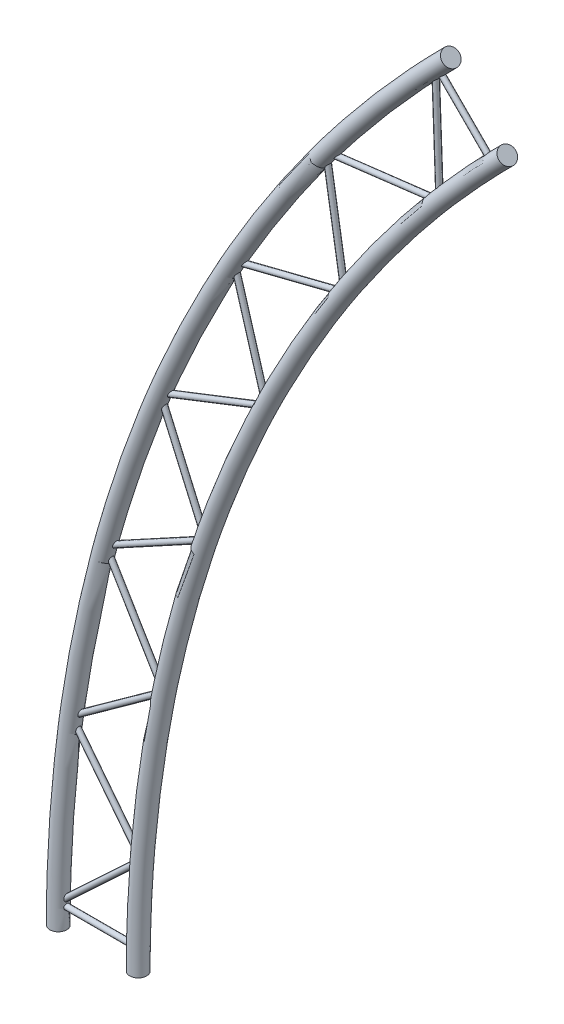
from build123d import *
from build123d.topology import SkipClean

# Parameters (mm, degrees)
ESQUISSE2_R                  = 25
R_VOLUTION1_ANGLE            = 45
ESQUISSE5_R                  = 8
ESQUISSE6_R                  = 8
ESQUISSE9_R                  = 8
ESQUISSE10_R                 = 8
R_P_TITION_CIRCULAIRE1_COUNT = 6
R_P_TITION_CIRCULAIRE1_ANGLE = 36
R_P_TITION_CIRCULAIRE2_COUNT = 6
R_P_TITION_CIRCULAIRE2_ANGLE = 36


with BuildPart() as part:
    # Esquisse2 → R_volution1 (revolve)
    with BuildSketch(Plane(origin=(0, 0, 0), x_dir=(1, 0, 0), z_dir=(0, 1, 0))):
        with Locations((-3975, 0)):
            Circle(ESQUISSE2_R)
        with Locations((-3738, 0)):
            Circle(ESQUISSE2_R)
    revolve(axis=Axis((0, 0, 0), (0, 0, -1)), revolution_arc=R_VOLUTION1_ANGLE)

    # Balayage1: sweep along a path in Esquisse3
    with BuildLine(Plane.XY) as balayage1_path:
        Line((-3974.547144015, 60), (-3737.518428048, 60))
    # Esquisse5 → Balayage1 (sweep)
    with BuildSketch(Plane(origin=(-3974.547144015, 60, 0), x_dir=(0, 0, -1), z_dir=(1, 0, 0))):
        Circle(ESQUISSE5_R)
    sweep(path=balayage1_path.line)

    # Balayage2: sweep along a path in Esquisse4
    with BuildLine(Plane.XY) as balayage2_path:
        Line((-2852.85564455, 2768.002830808), (-2685.251032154, 2600.398218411))
    # Esquisse6 → Balayage2 (sweep)
    with BuildSketch(Plane(origin=(-2852.85564455, 2768.002830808, 0), x_dir=(0.7071067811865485, 0.7071067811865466, 0), z_dir=(0.7071067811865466, -0.7071067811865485, 0))):
        Circle(ESQUISSE6_R)
    sweep(path=balayage2_path.line)

    # Balayage3: sweep along a path in Esquisse7
    with BuildLine(Plane.XY) as balayage3_path:
        Line((-3974.547144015, 60), (-3726.656088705, 290.995526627))
    # Esquisse9 → Balayage3 (sweep)
    with BuildSketch(Plane(origin=(-3974.547144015, 60, 0), x_dir=(0, 0, -1), z_dir=(0.7315989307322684, 0.6817352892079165, 0))):
        Circle(ESQUISSE9_R)
    balayage3 = sweep(path=balayage3_path.line)

    # Balayage4: sweep along a path in Esquisse8
    with BuildLine(Plane.XY) as balayage4_path:
        Line((-3935.686658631, 557.669727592), (-3726.656088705, 290.995526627))
    # Esquisse10 → Balayage4 (sweep)
    with BuildSketch(Plane(origin=(-3935.686658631, 557.669727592, 0), x_dir=(0.7870334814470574, 0.6169102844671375, 0), z_dir=(0.6169102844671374, -0.7870334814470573, 0))):
        Circle(ESQUISSE10_R)
    balayage4 = sweep(path=balayage4_path.line)

    # R_p_tition circulaire1: Balayage3 ×6 about axis
    r_p_tition_circulaire1_axis = Axis((0, 0, 444.405054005), (0, 0, -1))
    for i in range(1, R_P_TITION_CIRCULAIRE1_COUNT):
        add(balayage3.rotate(r_p_tition_circulaire1_axis, i * R_P_TITION_CIRCULAIRE1_ANGLE / (R_P_TITION_CIRCULAIRE1_COUNT - 1)))

    # R_p_tition circulaire2: Balayage4 ×6 about axis
    with SkipClean():  # the faces are left unmerged after this step: merging them gives an invalid solid
        r_p_tition_circulaire2_axis = Axis((0, 0, 444.405054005), (0, 0, -1))
        for i in range(1, R_P_TITION_CIRCULAIRE2_COUNT):
            add(balayage4.rotate(r_p_tition_circulaire2_axis, i * R_P_TITION_CIRCULAIRE2_ANGLE / (R_P_TITION_CIRCULAIRE2_COUNT - 1)))


solid = part.part
